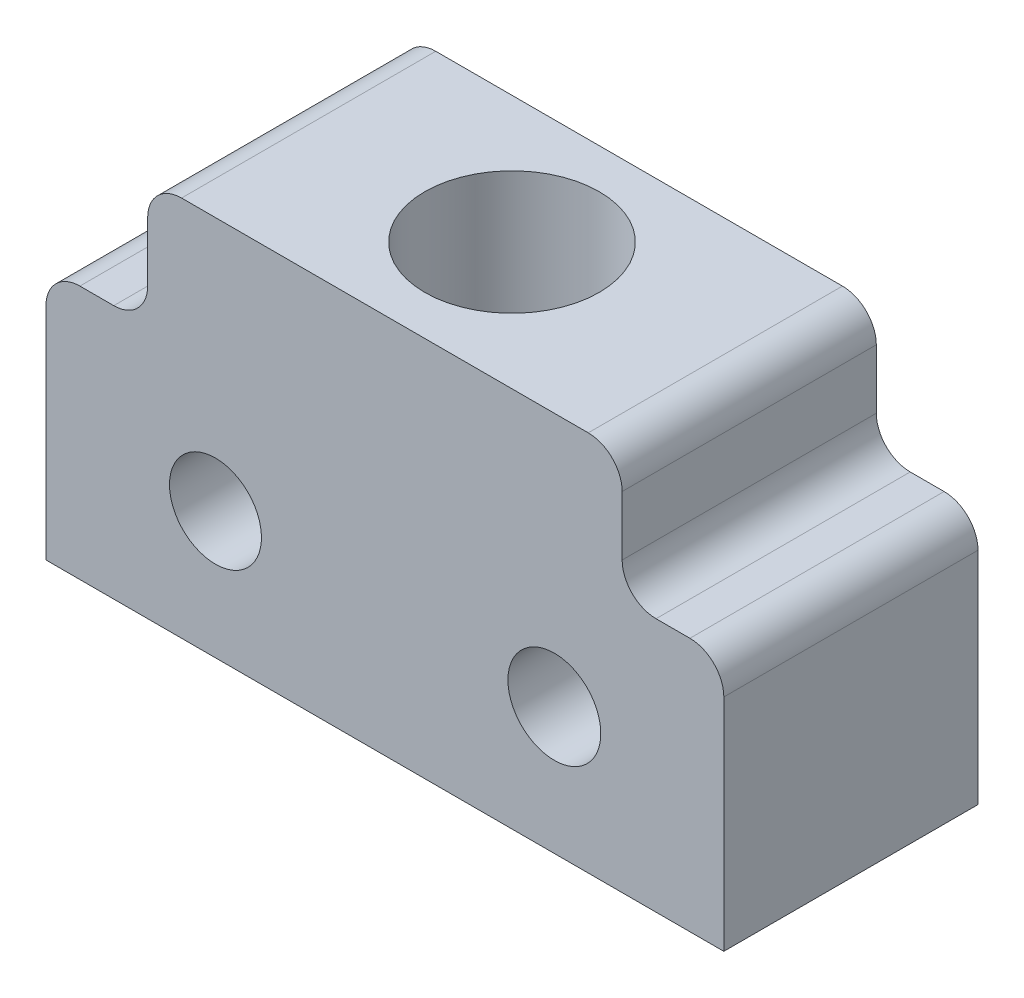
ISO-10303-21;
HEADER;
FILE_DESCRIPTION(('STEP AP214'),'2;1');
FILE_NAME('part.step','',(''),(''),'','','');
FILE_SCHEMA(('AUTOMOTIVE_DESIGN { 1 0 10303 214 1 1 1 1 }'));
ENDSEC;
DATA;
#1=APPLICATION_CONTEXT('core data for automotive mechanical design processes');
#2=APPLICATION_PROTOCOL_DEFINITION('international standard','automotive_design',2000,#1);
#3=PRODUCT_CONTEXT('',#1,'mechanical');
#4=PRODUCT('Part','Part','',(#3));
#5=PRODUCT_RELATED_PRODUCT_CATEGORY('part','',(#4));
#6=PRODUCT_DEFINITION_FORMATION('','',#4);
#7=PRODUCT_DEFINITION_CONTEXT('part definition',#1,'design');
#8=PRODUCT_DEFINITION('design','',#6,#7);
#9=PRODUCT_DEFINITION_SHAPE('','',#8);
#10=(LENGTH_UNIT() NAMED_UNIT(*) SI_UNIT(.MILLI.,.METRE.));
#11=(NAMED_UNIT(*) PLANE_ANGLE_UNIT() SI_UNIT($,.RADIAN.));
#12=(NAMED_UNIT(*) SI_UNIT($,.STERADIAN.) SOLID_ANGLE_UNIT());
#13=UNCERTAINTY_MEASURE_WITH_UNIT(LENGTH_MEASURE(1.E-05),#10,'distance_accuracy_value','');
#14=(GEOMETRIC_REPRESENTATION_CONTEXT(3) GLOBAL_UNCERTAINTY_ASSIGNED_CONTEXT((#13)) GLOBAL_UNIT_ASSIGNED_CONTEXT((#10,
#11,#12)) REPRESENTATION_CONTEXT('',''));
#15=CARTESIAN_POINT('',(0.,0.,0.));
#16=DIRECTION('',(0.,0.,1.));
#17=DIRECTION('',(1.,0.,0.));
#18=AXIS2_PLACEMENT_3D('',#15,#16,#17);
#19=CARTESIAN_POINT('',(0.,19.05,19.05));
#20=DIRECTION('',(0.,-1.,0.));
#21=DIRECTION('',(0.,0.,-1.));
#22=AXIS2_PLACEMENT_3D('',#19,#20,#21);
#23=PLANE('',#22);
#24=DIRECTION('',(-1.,0.,0.));
#25=VECTOR('',#24,1.);
#26=CARTESIAN_POINT('',(0.,19.05,0.));
#27=LINE('',#26,#25);
#28=CARTESIAN_POINT('',(5.08,19.05,0.));
#29=VERTEX_POINT('',#28);
#30=CARTESIAN_POINT('',(2.54,19.05,0.));
#31=VERTEX_POINT('',#30);
#32=EDGE_CURVE('E227',#29,#31,#27,.T.);
#33=ORIENTED_EDGE('',*,*,#32,.T.);
#34=DIRECTION('',(0.,0.,-1.));
#35=VECTOR('',#34,1.);
#36=CARTESIAN_POINT('',(2.54,19.05,19.05));
#37=LINE('',#36,#35);
#38=CARTESIAN_POINT('',(2.54,19.05,19.05));
#39=VERTEX_POINT('',#38);
#40=EDGE_CURVE('E186',#31,#39,#37,.F.);
#41=ORIENTED_EDGE('',*,*,#40,.T.);
#42=DIRECTION('',(-1.,0.,0.));
#43=VECTOR('',#42,1.);
#44=CARTESIAN_POINT('',(0.,19.05,19.05));
#45=LINE('',#44,#43);
#46=CARTESIAN_POINT('',(5.08,19.05,19.05));
#47=VERTEX_POINT('',#46);
#48=EDGE_CURVE('E241',#47,#39,#45,.T.);
#49=ORIENTED_EDGE('',*,*,#48,.F.);
#50=DIRECTION('',(0.,0.,1.));
#51=VECTOR('',#50,1.);
#52=CARTESIAN_POINT('',(5.08,19.05,0.));
#53=LINE('',#52,#51);
#54=EDGE_CURVE('E184',#47,#29,#53,.F.);
#55=ORIENTED_EDGE('',*,*,#54,.T.);
#56=EDGE_LOOP('',(#33,#41,#49,#55));
#57=FACE_BOUND('',#56,.T.);
#58=ADVANCED_FACE('F33',(#57),#23,.F.);
#59=CARTESIAN_POINT('',(48.26,19.05,19.05));
#60=VERTEX_POINT('',#59);
#61=CARTESIAN_POINT('',(45.72,19.05,19.05));
#62=VERTEX_POINT('',#61);
#63=EDGE_CURVE('E165',#60,#62,#45,.T.);
#64=ORIENTED_EDGE('',*,*,#63,.F.);
#65=DIRECTION('',(0.,0.,-1.));
#66=VECTOR('',#65,1.);
#67=CARTESIAN_POINT('',(48.26,19.05,19.05));
#68=LINE('',#67,#66);
#69=CARTESIAN_POINT('',(48.26,19.05,0.));
#70=VERTEX_POINT('',#69);
#71=EDGE_CURVE('E194',#60,#70,#68,.T.);
#72=ORIENTED_EDGE('',*,*,#71,.T.);
#73=CARTESIAN_POINT('',(45.72,19.05,0.));
#74=VERTEX_POINT('',#73);
#75=EDGE_CURVE('E146',#70,#74,#27,.T.);
#76=ORIENTED_EDGE('',*,*,#75,.T.);
#77=DIRECTION('',(0.,0.,-1.));
#78=VECTOR('',#77,1.);
#79=CARTESIAN_POINT('',(45.72,19.05,19.05));
#80=LINE('',#79,#78);
#81=EDGE_CURVE('E192',#74,#62,#80,.F.);
#82=ORIENTED_EDGE('',*,*,#81,.T.);
#83=EDGE_LOOP('',(#64,#72,#76,#82));
#84=FACE_BOUND('',#83,.T.);
#85=ADVANCED_FACE('F225',(#84),#23,.F.);
#86=CARTESIAN_POINT('',(0.,0.,19.05));
#87=DIRECTION('',(1.,0.,0.));
#88=DIRECTION('',(0.,0.,-1.));
#89=AXIS2_PLACEMENT_3D('',#86,#87,#88);
#90=PLANE('',#89);
#91=DIRECTION('',(0.,-1.,0.));
#92=VECTOR('',#91,1.);
#93=CARTESIAN_POINT('',(0.,0.,19.05));
#94=LINE('',#93,#92);
#95=CARTESIAN_POINT('',(0.,16.51,19.05));
#96=VERTEX_POINT('',#95);
#97=CARTESIAN_POINT('',(0.,0.,19.05));
#98=VERTEX_POINT('',#97);
#99=EDGE_CURVE('E133',#96,#98,#94,.T.);
#100=ORIENTED_EDGE('',*,*,#99,.F.);
#101=DIRECTION('',(0.,0.,-1.));
#102=VECTOR('',#101,1.);
#103=CARTESIAN_POINT('',(0.,16.51,19.05));
#104=LINE('',#103,#102);
#105=CARTESIAN_POINT('',(0.,16.51,0.));
#106=VERTEX_POINT('',#105);
#107=EDGE_CURVE('E182',#96,#106,#104,.T.);
#108=ORIENTED_EDGE('',*,*,#107,.T.);
#109=DIRECTION('',(0.,-1.,0.));
#110=VECTOR('',#109,1.);
#111=CARTESIAN_POINT('',(0.,0.,0.));
#112=LINE('',#111,#110);
#113=CARTESIAN_POINT('',(0.,0.,0.));
#114=VERTEX_POINT('',#113);
#115=EDGE_CURVE('E159',#106,#114,#112,.T.);
#116=ORIENTED_EDGE('',*,*,#115,.T.);
#117=DIRECTION('',(0.,0.,-1.));
#118=VECTOR('',#117,1.);
#119=CARTESIAN_POINT('',(0.,0.,19.05));
#120=LINE('',#119,#118);
#121=EDGE_CURVE('E151',#98,#114,#120,.T.);
#122=ORIENTED_EDGE('',*,*,#121,.F.);
#123=EDGE_LOOP('',(#100,#108,#116,#122));
#124=FACE_BOUND('',#123,.T.);
#125=ADVANCED_FACE('F157',(#124),#90,.F.);
#126=CARTESIAN_POINT('',(0.,0.,19.05));
#127=DIRECTION('',(0.,1.,0.));
#128=DIRECTION('',(0.,0.,1.));
#129=AXIS2_PLACEMENT_3D('',#126,#127,#128);
#130=PLANE('',#129);
#131=DIRECTION('',(1.,0.,0.));
#132=VECTOR('',#131,1.);
#133=CARTESIAN_POINT('',(0.,0.,0.));
#134=LINE('',#133,#132);
#135=CARTESIAN_POINT('',(50.8,0.,0.));
#136=VERTEX_POINT('',#135);
#137=EDGE_CURVE('E244',#114,#136,#134,.T.);
#138=ORIENTED_EDGE('',*,*,#137,.T.);
#139=DIRECTION('',(0.,0.,-1.));
#140=VECTOR('',#139,1.);
#141=CARTESIAN_POINT('',(50.8,0.,19.05));
#142=LINE('',#141,#140);
#143=CARTESIAN_POINT('',(50.8,0.,19.05));
#144=VERTEX_POINT('',#143);
#145=EDGE_CURVE('E153',#144,#136,#142,.T.);
#146=ORIENTED_EDGE('',*,*,#145,.F.);
#147=DIRECTION('',(1.,0.,0.));
#148=VECTOR('',#147,1.);
#149=CARTESIAN_POINT('',(0.,0.,19.05));
#150=LINE('',#149,#148);
#151=EDGE_CURVE('E137',#98,#144,#150,.T.);
#152=ORIENTED_EDGE('',*,*,#151,.F.);
#153=ORIENTED_EDGE('',*,*,#121,.T.);
#154=EDGE_LOOP('',(#138,#146,#152,#153));
#155=FACE_BOUND('',#154,.T.);
#156=ADVANCED_FACE('F150',(#155),#130,.F.);
#157=CARTESIAN_POINT('',(50.8,0.,19.05));
#158=DIRECTION('',(-1.,0.,0.));
#159=DIRECTION('',(0.,0.,1.));
#160=AXIS2_PLACEMENT_3D('',#157,#158,#159);
#161=PLANE('',#160);
#162=DIRECTION('',(0.,1.,0.));
#163=VECTOR('',#162,1.);
#164=CARTESIAN_POINT('',(50.8,0.,0.));
#165=LINE('',#164,#163);
#166=CARTESIAN_POINT('',(50.8,16.51,0.));
#167=VERTEX_POINT('',#166);
#168=EDGE_CURVE('E246',#136,#167,#165,.T.);
#169=ORIENTED_EDGE('',*,*,#168,.T.);
#170=DIRECTION('',(0.,0.,-1.));
#171=VECTOR('',#170,1.);
#172=CARTESIAN_POINT('',(50.8,16.51,19.05));
#173=LINE('',#172,#171);
#174=CARTESIAN_POINT('',(50.8,16.51,19.05));
#175=VERTEX_POINT('',#174);
#176=EDGE_CURVE('E201',#167,#175,#173,.F.);
#177=ORIENTED_EDGE('',*,*,#176,.T.);
#178=DIRECTION('',(0.,1.,0.));
#179=VECTOR('',#178,1.);
#180=CARTESIAN_POINT('',(50.8,0.,19.05));
#181=LINE('',#180,#179);
#182=EDGE_CURVE('E155',#144,#175,#181,.T.);
#183=ORIENTED_EDGE('',*,*,#182,.F.);
#184=ORIENTED_EDGE('',*,*,#145,.T.);
#185=EDGE_LOOP('',(#169,#177,#183,#184));
#186=FACE_BOUND('',#185,.T.);
#187=ADVANCED_FACE('F260',(#186),#161,.F.);
#188=CARTESIAN_POINT('',(0.,0.,19.05));
#189=DIRECTION('',(0.,0.,-1.));
#190=DIRECTION('',(-1.,0.,0.));
#191=AXIS2_PLACEMENT_3D('',#188,#189,#190);
#192=PLANE('',#191);
#193=CARTESIAN_POINT('',(12.7,9.525,19.05));
#194=DIRECTION('',(0.,0.,-1.));
#195=DIRECTION('',(-1.,0.,0.));
#196=AXIS2_PLACEMENT_3D('',#193,#194,#195);
#197=CIRCLE('',#196,3.44666093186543);
#198=CARTESIAN_POINT('',(9.25333906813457,9.525,19.05));
#199=VERTEX_POINT('',#198);
#200=EDGE_CURVE('E432',#199,#199,#197,.T.);
#201=ORIENTED_EDGE('',*,*,#200,.T.);
#202=EDGE_LOOP('',(#201));
#203=FACE_BOUND('',#202,.T.);
#204=CARTESIAN_POINT('',(38.1,9.525,19.05));
#205=DIRECTION('',(0.,0.,-1.));
#206=DIRECTION('',(-1.,0.,0.));
#207=AXIS2_PLACEMENT_3D('',#204,#205,#206);
#208=CIRCLE('',#207,3.48009670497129);
#209=CARTESIAN_POINT('',(34.6199032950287,9.525,19.05));
#210=VERTEX_POINT('',#209);
#211=EDGE_CURVE('E428',#210,#210,#208,.T.);
#212=ORIENTED_EDGE('',*,*,#211,.T.);
#213=EDGE_LOOP('',(#212));
#214=FACE_BOUND('',#213,.T.);
#215=ORIENTED_EDGE('',*,*,#182,.T.);
#216=CARTESIAN_POINT('',(48.26,16.51,19.05));
#217=DIRECTION('',(0.,0.,-1.));
#218=DIRECTION('',(-1.,0.,0.));
#219=AXIS2_PLACEMENT_3D('',#216,#217,#218);
#220=CIRCLE('',#219,2.54);
#221=EDGE_CURVE('E205',#175,#60,#220,.F.);
#222=ORIENTED_EDGE('',*,*,#221,.T.);
#223=ORIENTED_EDGE('',*,*,#63,.T.);
#224=CARTESIAN_POINT('',(45.72,21.59,19.05));
#225=DIRECTION('',(0.,0.,-1.));
#226=DIRECTION('',(-1.,0.,0.));
#227=AXIS2_PLACEMENT_3D('',#224,#225,#226);
#228=CIRCLE('',#227,2.54);
#229=CARTESIAN_POINT('',(43.18,21.59,19.05));
#230=VERTEX_POINT('',#229);
#231=EDGE_CURVE('E11',#62,#230,#228,.T.);
#232=ORIENTED_EDGE('',*,*,#231,.T.);
#233=DIRECTION('',(0.,-1.,0.));
#234=VECTOR('',#233,1.);
#235=CARTESIAN_POINT('',(43.18,28.575,19.05));
#236=LINE('',#235,#234);
#237=CARTESIAN_POINT('',(43.18,26.035,19.05));
#238=VERTEX_POINT('',#237);
#239=EDGE_CURVE('E230',#238,#230,#236,.T.);
#240=ORIENTED_EDGE('',*,*,#239,.F.);
#241=CARTESIAN_POINT('',(40.64,26.035,19.05));
#242=DIRECTION('',(0.,0.,-1.));
#243=DIRECTION('',(-1.,0.,0.));
#244=AXIS2_PLACEMENT_3D('',#241,#242,#243);
#245=CIRCLE('',#244,2.54);
#246=CARTESIAN_POINT('',(40.64,28.575,19.05));
#247=VERTEX_POINT('',#246);
#248=EDGE_CURVE('E203',#238,#247,#245,.F.);
#249=ORIENTED_EDGE('',*,*,#248,.T.);
#250=DIRECTION('',(1.,0.,0.));
#251=VECTOR('',#250,1.);
#252=CARTESIAN_POINT('',(7.62,28.575,19.05));
#253=LINE('',#252,#251);
#254=CARTESIAN_POINT('',(10.16,28.575,19.05));
#255=VERTEX_POINT('',#254);
#256=EDGE_CURVE('E423',#255,#247,#253,.T.);
#257=ORIENTED_EDGE('',*,*,#256,.F.);
#258=CARTESIAN_POINT('',(10.16,26.035,19.05));
#259=DIRECTION('',(0.,0.,-1.));
#260=DIRECTION('',(-1.,0.,0.));
#261=AXIS2_PLACEMENT_3D('',#258,#259,#260);
#262=CIRCLE('',#261,2.54);
#263=CARTESIAN_POINT('',(7.62,26.035,19.05));
#264=VERTEX_POINT('',#263);
#265=EDGE_CURVE('E170',#255,#264,#262,.F.);
#266=ORIENTED_EDGE('',*,*,#265,.T.);
#267=DIRECTION('',(0.,-1.,0.));
#268=VECTOR('',#267,1.);
#269=CARTESIAN_POINT('',(7.62,28.575,19.05));
#270=LINE('',#269,#268);
#271=CARTESIAN_POINT('',(7.62,21.59,19.05));
#272=VERTEX_POINT('',#271);
#273=EDGE_CURVE('E232',#264,#272,#270,.T.);
#274=ORIENTED_EDGE('',*,*,#273,.T.);
#275=CARTESIAN_POINT('',(5.08,21.59,19.05));
#276=DIRECTION('',(0.,0.,-1.));
#277=DIRECTION('',(-1.,0.,0.));
#278=AXIS2_PLACEMENT_3D('',#275,#276,#277);
#279=CIRCLE('',#278,2.54);
#280=EDGE_CURVE('E188',#272,#47,#279,.T.);
#281=ORIENTED_EDGE('',*,*,#280,.T.);
#282=ORIENTED_EDGE('',*,*,#48,.T.);
#283=CARTESIAN_POINT('',(2.54,16.51,19.05));
#284=DIRECTION('',(0.,0.,-1.));
#285=DIRECTION('',(-1.,0.,0.));
#286=AXIS2_PLACEMENT_3D('',#283,#284,#285);
#287=CIRCLE('',#286,2.54);
#288=EDGE_CURVE('E141',#39,#96,#287,.F.);
#289=ORIENTED_EDGE('',*,*,#288,.T.);
#290=ORIENTED_EDGE('',*,*,#99,.T.);
#291=ORIENTED_EDGE('',*,*,#151,.T.);
#292=EDGE_LOOP('',(#215,#222,#223,#232,#240,#249,#257,#266,#274,#281,#282,#289,#290,#291));
#293=FACE_BOUND('',#292,.T.);
#294=ADVANCED_FACE('F136',(#203,#214,#293),#192,.F.);
#295=CARTESIAN_POINT('',(0.,0.,0.));
#296=DIRECTION('',(0.,0.,-1.));
#297=DIRECTION('',(-1.,0.,0.));
#298=AXIS2_PLACEMENT_3D('',#295,#296,#297);
#299=PLANE('',#298);
#300=CARTESIAN_POINT('',(12.7,9.525,0.));
#301=DIRECTION('',(0.,0.,-1.));
#302=DIRECTION('',(-1.,0.,0.));
#303=AXIS2_PLACEMENT_3D('',#300,#301,#302);
#304=CIRCLE('',#303,3.44666093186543);
#305=CARTESIAN_POINT('',(9.25333906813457,9.525,0.));
#306=VERTEX_POINT('',#305);
#307=EDGE_CURVE('E435',#306,#306,#304,.T.);
#308=ORIENTED_EDGE('',*,*,#307,.F.);
#309=EDGE_LOOP('',(#308));
#310=FACE_BOUND('',#309,.T.);
#311=CARTESIAN_POINT('',(38.1,9.525,0.));
#312=DIRECTION('',(0.,0.,-1.));
#313=DIRECTION('',(-1.,0.,0.));
#314=AXIS2_PLACEMENT_3D('',#311,#312,#313);
#315=CIRCLE('',#314,3.48009670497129);
#316=CARTESIAN_POINT('',(34.6199032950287,9.525,0.));
#317=VERTEX_POINT('',#316);
#318=EDGE_CURVE('E429',#317,#317,#315,.T.);
#319=ORIENTED_EDGE('',*,*,#318,.F.);
#320=EDGE_LOOP('',(#319));
#321=FACE_BOUND('',#320,.T.);
#322=ORIENTED_EDGE('',*,*,#75,.F.);
#323=CARTESIAN_POINT('',(48.26,16.51,0.));
#324=DIRECTION('',(0.,0.,-1.));
#325=DIRECTION('',(-1.,0.,0.));
#326=AXIS2_PLACEMENT_3D('',#323,#324,#325);
#327=CIRCLE('',#326,2.54);
#328=EDGE_CURVE('E199',#70,#167,#327,.T.);
#329=ORIENTED_EDGE('',*,*,#328,.T.);
#330=ORIENTED_EDGE('',*,*,#168,.F.);
#331=ORIENTED_EDGE('',*,*,#137,.F.);
#332=ORIENTED_EDGE('',*,*,#115,.F.);
#333=CARTESIAN_POINT('',(2.54,16.51,0.));
#334=DIRECTION('',(0.,0.,-1.));
#335=DIRECTION('',(-1.,0.,0.));
#336=AXIS2_PLACEMENT_3D('',#333,#334,#335);
#337=CIRCLE('',#336,2.54);
#338=EDGE_CURVE('E177',#106,#31,#337,.T.);
#339=ORIENTED_EDGE('',*,*,#338,.T.);
#340=ORIENTED_EDGE('',*,*,#32,.F.);
#341=CARTESIAN_POINT('',(5.08,21.59,0.));
#342=DIRECTION('',(0.,0.,-1.));
#343=DIRECTION('',(-1.,0.,0.));
#344=AXIS2_PLACEMENT_3D('',#341,#342,#343);
#345=CIRCLE('',#344,2.54);
#346=CARTESIAN_POINT('',(7.62,21.59,0.));
#347=VERTEX_POINT('',#346);
#348=EDGE_CURVE('E190',#29,#347,#345,.F.);
#349=ORIENTED_EDGE('',*,*,#348,.T.);
#350=DIRECTION('',(0.,-1.,0.));
#351=VECTOR('',#350,1.);
#352=CARTESIAN_POINT('',(7.62,28.575,0.));
#353=LINE('',#352,#351);
#354=CARTESIAN_POINT('',(7.62,26.035,0.));
#355=VERTEX_POINT('',#354);
#356=EDGE_CURVE('E236',#355,#347,#353,.T.);
#357=ORIENTED_EDGE('',*,*,#356,.F.);
#358=CARTESIAN_POINT('',(10.16,26.035,0.));
#359=DIRECTION('',(0.,0.,-1.));
#360=DIRECTION('',(-1.,0.,0.));
#361=AXIS2_PLACEMENT_3D('',#358,#359,#360);
#362=CIRCLE('',#361,2.54);
#363=CARTESIAN_POINT('',(10.16,28.575,0.));
#364=VERTEX_POINT('',#363);
#365=EDGE_CURVE('E179',#355,#364,#362,.T.);
#366=ORIENTED_EDGE('',*,*,#365,.T.);
#367=DIRECTION('',(-1.,0.,0.));
#368=VECTOR('',#367,1.);
#369=CARTESIAN_POINT('',(7.62,28.575,0.));
#370=LINE('',#369,#368);
#371=CARTESIAN_POINT('',(40.64,28.575,0.));
#372=VERTEX_POINT('',#371);
#373=EDGE_CURVE('E422',#372,#364,#370,.T.);
#374=ORIENTED_EDGE('',*,*,#373,.F.);
#375=CARTESIAN_POINT('',(40.64,26.035,0.));
#376=DIRECTION('',(0.,0.,-1.));
#377=DIRECTION('',(-1.,0.,0.));
#378=AXIS2_PLACEMENT_3D('',#375,#376,#377);
#379=CIRCLE('',#378,2.54);
#380=CARTESIAN_POINT('',(43.18,26.035,0.));
#381=VERTEX_POINT('',#380);
#382=EDGE_CURVE('E197',#372,#381,#379,.T.);
#383=ORIENTED_EDGE('',*,*,#382,.T.);
#384=DIRECTION('',(0.,-1.,0.));
#385=VECTOR('',#384,1.);
#386=CARTESIAN_POINT('',(43.18,28.575,0.));
#387=LINE('',#386,#385);
#388=CARTESIAN_POINT('',(43.18,21.59,0.));
#389=VERTEX_POINT('',#388);
#390=EDGE_CURVE('E219',#381,#389,#387,.T.);
#391=ORIENTED_EDGE('',*,*,#390,.T.);
#392=CARTESIAN_POINT('',(45.72,21.59,0.));
#393=DIRECTION('',(0.,0.,-1.));
#394=DIRECTION('',(-1.,0.,0.));
#395=AXIS2_PLACEMENT_3D('',#392,#393,#394);
#396=CIRCLE('',#395,2.54);
#397=EDGE_CURVE('E42',#389,#74,#396,.F.);
#398=ORIENTED_EDGE('',*,*,#397,.T.);
#399=EDGE_LOOP('',(#322,#329,#330,#331,#332,#339,#340,#349,#357,#366,#374,#383,#391,#398));
#400=FACE_BOUND('',#399,.T.);
#401=ADVANCED_FACE('F218',(#310,#321,#400),#299,.T.);
#402=CARTESIAN_POINT('',(7.62,28.575,0.));
#403=DIRECTION('',(1.,0.,0.));
#404=DIRECTION('',(0.,0.,-1.));
#405=AXIS2_PLACEMENT_3D('',#402,#403,#404);
#406=PLANE('',#405);
#407=ORIENTED_EDGE('',*,*,#273,.F.);
#408=DIRECTION('',(0.,0.,1.));
#409=VECTOR('',#408,1.);
#410=CARTESIAN_POINT('',(7.62,26.035,0.));
#411=LINE('',#410,#409);
#412=EDGE_CURVE('E175',#264,#355,#411,.F.);
#413=ORIENTED_EDGE('',*,*,#412,.T.);
#414=ORIENTED_EDGE('',*,*,#356,.T.);
#415=DIRECTION('',(0.,0.,1.));
#416=VECTOR('',#415,1.);
#417=CARTESIAN_POINT('',(7.62,21.59,19.05));
#418=LINE('',#417,#416);
#419=EDGE_CURVE('E172',#347,#272,#418,.T.);
#420=ORIENTED_EDGE('',*,*,#419,.T.);
#421=EDGE_LOOP('',(#407,#413,#414,#420));
#422=FACE_BOUND('',#421,.T.);
#423=ADVANCED_FACE('F327',(#422),#406,.F.);
#424=CARTESIAN_POINT('',(43.18,28.575,0.));
#425=DIRECTION('',(-1.,0.,0.));
#426=DIRECTION('',(0.,0.,1.));
#427=AXIS2_PLACEMENT_3D('',#424,#425,#426);
#428=PLANE('',#427);
#429=ORIENTED_EDGE('',*,*,#239,.T.);
#430=DIRECTION('',(0.,0.,-1.));
#431=VECTOR('',#430,1.);
#432=CARTESIAN_POINT('',(43.18,21.59,0.));
#433=LINE('',#432,#431);
#434=EDGE_CURVE('E208',#230,#389,#433,.T.);
#435=ORIENTED_EDGE('',*,*,#434,.T.);
#436=ORIENTED_EDGE('',*,*,#390,.F.);
#437=DIRECTION('',(0.,0.,-1.));
#438=VECTOR('',#437,1.);
#439=CARTESIAN_POINT('',(43.18,26.035,19.05));
#440=LINE('',#439,#438);
#441=EDGE_CURVE('E54',#381,#238,#440,.F.);
#442=ORIENTED_EDGE('',*,*,#441,.T.);
#443=EDGE_LOOP('',(#429,#435,#436,#442));
#444=FACE_BOUND('',#443,.T.);
#445=ADVANCED_FACE('F229',(#444),#428,.F.);
#446=CARTESIAN_POINT('',(0.,28.575,0.));
#447=DIRECTION('',(0.,1.,0.));
#448=DIRECTION('',(0.,0.,1.));
#449=AXIS2_PLACEMENT_3D('',#446,#447,#448);
#450=PLANE('',#449);
#451=CARTESIAN_POINT('',(25.4,28.575,9.525));
#452=DIRECTION('',(0.,1.,0.));
#453=DIRECTION('',(0.,0.,1.));
#454=AXIS2_PLACEMENT_3D('',#451,#452,#453);
#455=CIRCLE('',#454,6.5405);
#456=CARTESIAN_POINT('',(25.4,28.575,16.0655));
#457=VERTEX_POINT('',#456);
#458=EDGE_CURVE('E443',#457,#457,#455,.T.);
#459=ORIENTED_EDGE('',*,*,#458,.F.);
#460=EDGE_LOOP('',(#459));
#461=FACE_BOUND('',#460,.T.);
#462=ORIENTED_EDGE('',*,*,#256,.T.);
#463=DIRECTION('',(0.,0.,-1.));
#464=VECTOR('',#463,1.);
#465=CARTESIAN_POINT('',(40.64,28.575,0.));
#466=LINE('',#465,#464);
#467=EDGE_CURVE('E211',#247,#372,#466,.T.);
#468=ORIENTED_EDGE('',*,*,#467,.T.);
#469=ORIENTED_EDGE('',*,*,#373,.T.);
#470=DIRECTION('',(0.,0.,1.));
#471=VECTOR('',#470,1.);
#472=CARTESIAN_POINT('',(10.16,28.575,19.05));
#473=LINE('',#472,#471);
#474=EDGE_CURVE('E161',#364,#255,#473,.T.);
#475=ORIENTED_EDGE('',*,*,#474,.T.);
#476=EDGE_LOOP('',(#462,#468,#469,#475));
#477=FACE_BOUND('',#476,.T.);
#478=ADVANCED_FACE('F334',(#461,#477),#450,.T.);
#479=CARTESIAN_POINT('',(38.1,9.525,19.05));
#480=DIRECTION('',(0.,0.,-1.));
#481=DIRECTION('',(-1.,0.,0.));
#482=AXIS2_PLACEMENT_3D('',#479,#480,#481);
#483=CYLINDRICAL_SURFACE('',#482,3.48009670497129);
#484=CARTESIAN_POINT('',(34.6199032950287,9.525,19.05));
#485=CARTESIAN_POINT('',(34.6199032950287,9.525,18.8515625));
#486=CARTESIAN_POINT('',(34.6199032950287,9.525,18.653125));
#487=CARTESIAN_POINT('',(34.6199032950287,9.525,18.25625));
#488=CARTESIAN_POINT('',(34.6199032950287,9.525,18.0578125));
#489=CARTESIAN_POINT('',(34.6199032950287,9.525,17.6609375));
#490=CARTESIAN_POINT('',(34.6199032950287,9.525,17.4625));
#491=CARTESIAN_POINT('',(34.6199032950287,9.525,17.065625));
#492=CARTESIAN_POINT('',(34.6199032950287,9.525,16.8671875));
#493=CARTESIAN_POINT('',(34.6199032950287,9.525,16.4703125));
#494=CARTESIAN_POINT('',(34.6199032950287,9.525,16.271875));
#495=CARTESIAN_POINT('',(34.6199032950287,9.525,15.875));
#496=CARTESIAN_POINT('',(34.6199032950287,9.525,15.6765625));
#497=CARTESIAN_POINT('',(34.6199032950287,9.525,15.2796875));
#498=CARTESIAN_POINT('',(34.6199032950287,9.525,15.08125));
#499=CARTESIAN_POINT('',(34.6199032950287,9.525,14.684375));
#500=CARTESIAN_POINT('',(34.6199032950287,9.525,14.4859375));
#501=CARTESIAN_POINT('',(34.6199032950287,9.525,14.0890625));
#502=CARTESIAN_POINT('',(34.6199032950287,9.525,13.890625));
#503=CARTESIAN_POINT('',(34.6199032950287,9.525,13.49375));
#504=CARTESIAN_POINT('',(34.6199032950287,9.525,13.2953125));
#505=CARTESIAN_POINT('',(34.6199032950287,9.525,12.8984375));
#506=CARTESIAN_POINT('',(34.6199032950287,9.525,12.7));
#507=CARTESIAN_POINT('',(34.6199032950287,9.525,12.303125));
#508=CARTESIAN_POINT('',(34.6199032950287,9.525,12.1046875));
#509=CARTESIAN_POINT('',(34.6199032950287,9.525,11.7078125));
#510=CARTESIAN_POINT('',(34.6199032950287,9.525,11.509375));
#511=CARTESIAN_POINT('',(34.6199032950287,9.525,11.1125));
#512=CARTESIAN_POINT('',(34.6199032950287,9.525,10.9140625));
#513=CARTESIAN_POINT('',(34.6199032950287,9.525,10.5171875));
#514=CARTESIAN_POINT('',(34.6199032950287,9.525,10.31875));
#515=CARTESIAN_POINT('',(34.6199032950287,9.525,9.921875));
#516=CARTESIAN_POINT('',(34.6199032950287,9.525,9.7234375));
#517=CARTESIAN_POINT('',(34.6199032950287,9.525,9.3265625));
#518=CARTESIAN_POINT('',(34.6199032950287,9.525,9.128125));
#519=CARTESIAN_POINT('',(34.6199032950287,9.525,8.73125));
#520=CARTESIAN_POINT('',(34.6199032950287,9.525,8.5328125));
#521=CARTESIAN_POINT('',(34.6199032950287,9.525,8.1359375));
#522=CARTESIAN_POINT('',(34.6199032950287,9.525,7.9375));
#523=CARTESIAN_POINT('',(34.6199032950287,9.525,7.540625));
#524=CARTESIAN_POINT('',(34.6199032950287,9.525,7.3421875));
#525=CARTESIAN_POINT('',(34.6199032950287,9.525,6.9453125));
#526=CARTESIAN_POINT('',(34.6199032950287,9.525,6.746875));
#527=CARTESIAN_POINT('',(34.6199032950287,9.525,6.35));
#528=CARTESIAN_POINT('',(34.6199032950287,9.525,6.1515625));
#529=CARTESIAN_POINT('',(34.6199032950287,9.525,5.7546875));
#530=CARTESIAN_POINT('',(34.6199032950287,9.525,5.55625));
#531=CARTESIAN_POINT('',(34.6199032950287,9.525,5.159375));
#532=CARTESIAN_POINT('',(34.6199032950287,9.525,4.9609375));
#533=CARTESIAN_POINT('',(34.6199032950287,9.525,4.5640625));
#534=CARTESIAN_POINT('',(34.6199032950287,9.525,4.365625));
#535=CARTESIAN_POINT('',(34.6199032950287,9.525,3.96875));
#536=CARTESIAN_POINT('',(34.6199032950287,9.525,3.7703125));
#537=CARTESIAN_POINT('',(34.6199032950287,9.525,3.3734375));
#538=CARTESIAN_POINT('',(34.6199032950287,9.525,3.175));
#539=CARTESIAN_POINT('',(34.6199032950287,9.525,2.778125));
#540=CARTESIAN_POINT('',(34.6199032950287,9.525,2.5796875));
#541=CARTESIAN_POINT('',(34.6199032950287,9.525,2.1828125));
#542=CARTESIAN_POINT('',(34.6199032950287,9.525,1.984375));
#543=CARTESIAN_POINT('',(34.6199032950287,9.525,1.5875));
#544=CARTESIAN_POINT('',(34.6199032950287,9.525,1.3890625));
#545=CARTESIAN_POINT('',(34.6199032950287,9.525,0.992187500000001));
#546=CARTESIAN_POINT('',(34.6199032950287,9.525,0.793750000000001));
#547=CARTESIAN_POINT('',(34.6199032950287,9.525,0.396875));
#548=CARTESIAN_POINT('',(34.6199032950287,9.525,0.1984375));
#549=CARTESIAN_POINT('',(34.6199032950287,9.525,0.));
#550=B_SPLINE_CURVE_WITH_KNOTS('',3,(#484,#485,#486,#487,#488,#489,#490,#491,#492,#493,#494,
#495,#496,#497,#498,#499,#500,#501,#502,#503,#504,#505,#506,#507,#508,#509,#510,#511,#512,#513,
#514,#515,#516,#517,#518,#519,#520,#521,#522,#523,#524,#525,#526,#527,#528,#529,#530,#531,#532,
#533,#534,#535,#536,#537,#538,#539,#540,#541,#542,#543,#544,#545,#546,#547,#548,#549),
.UNSPECIFIED.,.F.,.F.,(4,2,2,2,2,2,2,2,2,2,2,2,2,2,2,2,2,2,2,2,2,2,2,2,2,2,2,2,2,2,2,2,4),(0.,
0.5953125,1.190625,1.7859375,2.38125,2.9765625,3.571875,4.1671875,4.7625,5.3578125,5.953125,
6.5484375,7.14375,7.7390625,8.334375,8.9296875,9.525,10.1203125,10.715625,11.3109375,11.90625,
12.5015625,13.096875,13.6921875,14.2875,14.8828125,15.478125,16.0734375,16.66875,17.2640625,
17.859375,18.4546875,19.05),.UNSPECIFIED.);
#551=EDGE_CURVE('BSEAM374',#210,#317,#550,.T.);
#552=ORIENTED_EDGE('',*,*,#211,.F.);
#553=ORIENTED_EDGE('',*,*,#318,.T.);
#554=ORIENTED_EDGE('',*,*,#551,.T.);
#555=ORIENTED_EDGE('',*,*,#551,.F.);
#556=EDGE_LOOP('',(#552,#554,#553,#555));
#557=FACE_BOUND('',#556,.T.);
#558=ADVANCED_FACE('F374',(#557),#483,.F.);
#559=CARTESIAN_POINT('',(12.7,9.525,19.05));
#560=DIRECTION('',(0.,0.,-1.));
#561=DIRECTION('',(-1.,0.,0.));
#562=AXIS2_PLACEMENT_3D('',#559,#560,#561);
#563=CYLINDRICAL_SURFACE('',#562,3.44666093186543);
#564=CARTESIAN_POINT('',(9.25333906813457,9.525,19.05));
#565=CARTESIAN_POINT('',(9.25333906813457,9.525,18.8515625));
#566=CARTESIAN_POINT('',(9.25333906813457,9.525,18.653125));
#567=CARTESIAN_POINT('',(9.25333906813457,9.525,18.25625));
#568=CARTESIAN_POINT('',(9.25333906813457,9.525,18.0578125));
#569=CARTESIAN_POINT('',(9.25333906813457,9.525,17.6609375));
#570=CARTESIAN_POINT('',(9.25333906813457,9.525,17.4625));
#571=CARTESIAN_POINT('',(9.25333906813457,9.525,17.065625));
#572=CARTESIAN_POINT('',(9.25333906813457,9.525,16.8671875));
#573=CARTESIAN_POINT('',(9.25333906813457,9.525,16.4703125));
#574=CARTESIAN_POINT('',(9.25333906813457,9.525,16.271875));
#575=CARTESIAN_POINT('',(9.25333906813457,9.525,15.875));
#576=CARTESIAN_POINT('',(9.25333906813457,9.525,15.6765625));
#577=CARTESIAN_POINT('',(9.25333906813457,9.525,15.2796875));
#578=CARTESIAN_POINT('',(9.25333906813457,9.525,15.08125));
#579=CARTESIAN_POINT('',(9.25333906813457,9.525,14.684375));
#580=CARTESIAN_POINT('',(9.25333906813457,9.525,14.4859375));
#581=CARTESIAN_POINT('',(9.25333906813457,9.525,14.0890625));
#582=CARTESIAN_POINT('',(9.25333906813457,9.525,13.890625));
#583=CARTESIAN_POINT('',(9.25333906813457,9.525,13.49375));
#584=CARTESIAN_POINT('',(9.25333906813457,9.525,13.2953125));
#585=CARTESIAN_POINT('',(9.25333906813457,9.525,12.8984375));
#586=CARTESIAN_POINT('',(9.25333906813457,9.525,12.7));
#587=CARTESIAN_POINT('',(9.25333906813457,9.525,12.303125));
#588=CARTESIAN_POINT('',(9.25333906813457,9.525,12.1046875));
#589=CARTESIAN_POINT('',(9.25333906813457,9.525,11.7078125));
#590=CARTESIAN_POINT('',(9.25333906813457,9.525,11.509375));
#591=CARTESIAN_POINT('',(9.25333906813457,9.525,11.1125));
#592=CARTESIAN_POINT('',(9.25333906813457,9.525,10.9140625));
#593=CARTESIAN_POINT('',(9.25333906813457,9.525,10.5171875));
#594=CARTESIAN_POINT('',(9.25333906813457,9.525,10.31875));
#595=CARTESIAN_POINT('',(9.25333906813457,9.525,9.921875));
#596=CARTESIAN_POINT('',(9.25333906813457,9.525,9.7234375));
#597=CARTESIAN_POINT('',(9.25333906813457,9.525,9.3265625));
#598=CARTESIAN_POINT('',(9.25333906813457,9.525,9.128125));
#599=CARTESIAN_POINT('',(9.25333906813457,9.525,8.73125));
#600=CARTESIAN_POINT('',(9.25333906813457,9.525,8.5328125));
#601=CARTESIAN_POINT('',(9.25333906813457,9.525,8.1359375));
#602=CARTESIAN_POINT('',(9.25333906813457,9.525,7.9375));
#603=CARTESIAN_POINT('',(9.25333906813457,9.525,7.540625));
#604=CARTESIAN_POINT('',(9.25333906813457,9.525,7.3421875));
#605=CARTESIAN_POINT('',(9.25333906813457,9.525,6.9453125));
#606=CARTESIAN_POINT('',(9.25333906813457,9.525,6.746875));
#607=CARTESIAN_POINT('',(9.25333906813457,9.525,6.35));
#608=CARTESIAN_POINT('',(9.25333906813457,9.525,6.1515625));
#609=CARTESIAN_POINT('',(9.25333906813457,9.525,5.7546875));
#610=CARTESIAN_POINT('',(9.25333906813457,9.525,5.55625));
#611=CARTESIAN_POINT('',(9.25333906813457,9.525,5.159375));
#612=CARTESIAN_POINT('',(9.25333906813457,9.525,4.9609375));
#613=CARTESIAN_POINT('',(9.25333906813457,9.525,4.5640625));
#614=CARTESIAN_POINT('',(9.25333906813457,9.525,4.365625));
#615=CARTESIAN_POINT('',(9.25333906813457,9.525,3.96875));
#616=CARTESIAN_POINT('',(9.25333906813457,9.525,3.7703125));
#617=CARTESIAN_POINT('',(9.25333906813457,9.525,3.3734375));
#618=CARTESIAN_POINT('',(9.25333906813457,9.525,3.175));
#619=CARTESIAN_POINT('',(9.25333906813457,9.525,2.778125));
#620=CARTESIAN_POINT('',(9.25333906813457,9.525,2.5796875));
#621=CARTESIAN_POINT('',(9.25333906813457,9.525,2.1828125));
#622=CARTESIAN_POINT('',(9.25333906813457,9.525,1.984375));
#623=CARTESIAN_POINT('',(9.25333906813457,9.525,1.5875));
#624=CARTESIAN_POINT('',(9.25333906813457,9.525,1.3890625));
#625=CARTESIAN_POINT('',(9.25333906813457,9.525,0.992187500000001));
#626=CARTESIAN_POINT('',(9.25333906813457,9.525,0.793750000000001));
#627=CARTESIAN_POINT('',(9.25333906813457,9.525,0.396875));
#628=CARTESIAN_POINT('',(9.25333906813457,9.525,0.1984375));
#629=CARTESIAN_POINT('',(9.25333906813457,9.525,0.));
#630=B_SPLINE_CURVE_WITH_KNOTS('',3,(#564,#565,#566,#567,#568,#569,#570,#571,#572,#573,#574,
#575,#576,#577,#578,#579,#580,#581,#582,#583,#584,#585,#586,#587,#588,#589,#590,#591,#592,#593,
#594,#595,#596,#597,#598,#599,#600,#601,#602,#603,#604,#605,#606,#607,#608,#609,#610,#611,#612,
#613,#614,#615,#616,#617,#618,#619,#620,#621,#622,#623,#624,#625,#626,#627,#628,#629),
.UNSPECIFIED.,.F.,.F.,(4,2,2,2,2,2,2,2,2,2,2,2,2,2,2,2,2,2,2,2,2,2,2,2,2,2,2,2,2,2,2,2,4),(0.,
0.5953125,1.190625,1.7859375,2.38125,2.9765625,3.571875,4.1671875,4.7625,5.3578125,5.953125,
6.5484375,7.14375,7.7390625,8.334375,8.9296875,9.525,10.1203125,10.715625,11.3109375,11.90625,
12.5015625,13.096875,13.6921875,14.2875,14.8828125,15.478125,16.0734375,16.66875,17.2640625,
17.859375,18.4546875,19.05),.UNSPECIFIED.);
#631=EDGE_CURVE('BSEAM291',#199,#306,#630,.T.);
#632=ORIENTED_EDGE('',*,*,#200,.F.);
#633=ORIENTED_EDGE('',*,*,#307,.T.);
#634=ORIENTED_EDGE('',*,*,#631,.T.);
#635=ORIENTED_EDGE('',*,*,#631,.F.);
#636=EDGE_LOOP('',(#632,#634,#633,#635));
#637=FACE_BOUND('',#636,.T.);
#638=ADVANCED_FACE('F291',(#637),#563,.F.);
#639=CARTESIAN_POINT('',(10.16,26.035,0.));
#640=DIRECTION('',(0.,0.,-1.));
#641=DIRECTION('',(-1.,0.,0.));
#642=AXIS2_PLACEMENT_3D('',#639,#640,#641);
#643=CYLINDRICAL_SURFACE('',#642,2.54);
#644=ORIENTED_EDGE('',*,*,#365,.F.);
#645=ORIENTED_EDGE('',*,*,#412,.F.);
#646=ORIENTED_EDGE('',*,*,#265,.F.);
#647=ORIENTED_EDGE('',*,*,#474,.F.);
#648=EDGE_LOOP('',(#644,#645,#646,#647));
#649=FACE_BOUND('',#648,.T.);
#650=ADVANCED_FACE('F288',(#649),#643,.T.);
#651=CARTESIAN_POINT('',(2.54,16.51,19.05));
#652=DIRECTION('',(0.,0.,-1.));
#653=DIRECTION('',(-1.,0.,0.));
#654=AXIS2_PLACEMENT_3D('',#651,#652,#653);
#655=CYLINDRICAL_SURFACE('',#654,2.54);
#656=ORIENTED_EDGE('',*,*,#288,.F.);
#657=ORIENTED_EDGE('',*,*,#40,.F.);
#658=ORIENTED_EDGE('',*,*,#338,.F.);
#659=ORIENTED_EDGE('',*,*,#107,.F.);
#660=EDGE_LOOP('',(#656,#657,#658,#659));
#661=FACE_BOUND('',#660,.T.);
#662=ADVANCED_FACE('F259',(#661),#655,.T.);
#663=CARTESIAN_POINT('',(5.08,21.59,0.));
#664=DIRECTION('',(0.,0.,-1.));
#665=DIRECTION('',(-1.,0.,0.));
#666=AXIS2_PLACEMENT_3D('',#663,#664,#665);
#667=CYLINDRICAL_SURFACE('',#666,2.54);
#668=ORIENTED_EDGE('',*,*,#348,.F.);
#669=ORIENTED_EDGE('',*,*,#54,.F.);
#670=ORIENTED_EDGE('',*,*,#280,.F.);
#671=ORIENTED_EDGE('',*,*,#419,.F.);
#672=EDGE_LOOP('',(#668,#669,#670,#671));
#673=FACE_BOUND('',#672,.T.);
#674=ADVANCED_FACE('F265',(#673),#667,.F.);
#675=CARTESIAN_POINT('',(48.26,16.51,19.05));
#676=DIRECTION('',(0.,0.,-1.));
#677=DIRECTION('',(-1.,0.,0.));
#678=AXIS2_PLACEMENT_3D('',#675,#676,#677);
#679=CYLINDRICAL_SURFACE('',#678,2.54);
#680=ORIENTED_EDGE('',*,*,#221,.F.);
#681=ORIENTED_EDGE('',*,*,#176,.F.);
#682=ORIENTED_EDGE('',*,*,#328,.F.);
#683=ORIENTED_EDGE('',*,*,#71,.F.);
#684=EDGE_LOOP('',(#680,#681,#682,#683));
#685=FACE_BOUND('',#684,.T.);
#686=ADVANCED_FACE('F263',(#685),#679,.T.);
#687=CARTESIAN_POINT('',(45.72,21.59,0.));
#688=DIRECTION('',(0.,0.,1.));
#689=DIRECTION('',(1.,0.,0.));
#690=AXIS2_PLACEMENT_3D('',#687,#688,#689);
#691=CYLINDRICAL_SURFACE('',#690,2.54);
#692=ORIENTED_EDGE('',*,*,#231,.F.);
#693=ORIENTED_EDGE('',*,*,#81,.F.);
#694=ORIENTED_EDGE('',*,*,#397,.F.);
#695=ORIENTED_EDGE('',*,*,#434,.F.);
#696=EDGE_LOOP('',(#692,#693,#694,#695));
#697=FACE_BOUND('',#696,.T.);
#698=ADVANCED_FACE('F228',(#697),#691,.F.);
#699=CARTESIAN_POINT('',(40.64,26.035,0.));
#700=DIRECTION('',(0.,0.,1.));
#701=DIRECTION('',(1.,0.,0.));
#702=AXIS2_PLACEMENT_3D('',#699,#700,#701);
#703=CYLINDRICAL_SURFACE('',#702,2.54);
#704=ORIENTED_EDGE('',*,*,#248,.F.);
#705=ORIENTED_EDGE('',*,*,#441,.F.);
#706=ORIENTED_EDGE('',*,*,#382,.F.);
#707=ORIENTED_EDGE('',*,*,#467,.F.);
#708=EDGE_LOOP('',(#704,#705,#706,#707));
#709=FACE_BOUND('',#708,.T.);
#710=ADVANCED_FACE('F35',(#709),#703,.T.);
#711=CARTESIAN_POINT('',(25.4,17.907,9.525));
#712=DIRECTION('',(0.,1.,0.));
#713=DIRECTION('',(0.,0.,1.));
#714=AXIS2_PLACEMENT_3D('',#711,#712,#713);
#715=PLANE('',#714);
#716=CARTESIAN_POINT('',(25.4,17.907,9.525));
#717=DIRECTION('',(0.,1.,0.));
#718=DIRECTION('',(0.,0.,1.));
#719=AXIS2_PLACEMENT_3D('',#716,#717,#718);
#720=CIRCLE('',#719,6.5405);
#721=CARTESIAN_POINT('',(25.4,17.907,16.0655));
#722=VERTEX_POINT('',#721);
#723=EDGE_CURVE('E446',#722,#722,#720,.T.);
#724=ORIENTED_EDGE('',*,*,#723,.T.);
#725=EDGE_LOOP('',(#724));
#726=FACE_BOUND('',#725,.T.);
#727=CARTESIAN_POINT('',(25.4,17.907,9.525));
#728=DIRECTION('',(0.,1.,0.));
#729=DIRECTION('',(0.,0.,1.));
#730=AXIS2_PLACEMENT_3D('',#727,#728,#729);
#731=CIRCLE('',#730,6.35);
#732=CARTESIAN_POINT('',(25.4,17.907,15.875));
#733=VERTEX_POINT('',#732);
#734=EDGE_CURVE('E37',#733,#733,#731,.F.);
#735=ORIENTED_EDGE('',*,*,#734,.T.);
#736=EDGE_LOOP('',(#735));
#737=FACE_BOUND('',#736,.T.);
#738=ADVANCED_FACE('F353',(#726,#737),#715,.T.);
#739=CARTESIAN_POINT('',(25.4,17.907,9.525));
#740=DIRECTION('',(0.,1.,0.));
#741=DIRECTION('',(0.,0.,1.));
#742=AXIS2_PLACEMENT_3D('',#739,#740,#741);
#743=CYLINDRICAL_SURFACE('',#742,6.5405);
#744=ORIENTED_EDGE('',*,*,#723,.F.);
#745=EDGE_LOOP('',(#744));
#746=FACE_BOUND('',#745,.T.);
#747=ORIENTED_EDGE('',*,*,#458,.T.);
#748=EDGE_LOOP('',(#747));
#749=FACE_BOUND('',#748,.T.);
#750=ADVANCED_FACE('F364',(#746,#749),#743,.F.);
#751=CARTESIAN_POINT('',(25.4,16.383,9.525));
#752=DIRECTION('',(0.,1.,0.));
#753=DIRECTION('',(0.,0.,1.));
#754=AXIS2_PLACEMENT_3D('',#751,#752,#753);
#755=PLANE('',#754);
#756=CARTESIAN_POINT('',(25.4,16.383,9.525));
#757=DIRECTION('',(0.,1.,0.));
#758=DIRECTION('',(0.,0.,1.));
#759=AXIS2_PLACEMENT_3D('',#756,#757,#758);
#760=CIRCLE('',#759,6.35);
#761=CARTESIAN_POINT('',(25.4,16.383,15.875));
#762=VERTEX_POINT('',#761);
#763=EDGE_CURVE('E438',#762,#762,#760,.T.);
#764=ORIENTED_EDGE('',*,*,#763,.T.);
#765=EDGE_LOOP('',(#764));
#766=FACE_BOUND('',#765,.T.);
#767=ADVANCED_FACE('F360',(#766),#755,.T.);
#768=CARTESIAN_POINT('',(25.4,16.383,9.525));
#769=DIRECTION('',(0.,1.,0.));
#770=DIRECTION('',(0.,0.,1.));
#771=AXIS2_PLACEMENT_3D('',#768,#769,#770);
#772=CYLINDRICAL_SURFACE('',#771,6.35);
#773=ORIENTED_EDGE('',*,*,#763,.F.);
#774=EDGE_LOOP('',(#773));
#775=FACE_BOUND('',#774,.T.);
#776=ORIENTED_EDGE('',*,*,#734,.F.);
#777=EDGE_LOOP('',(#776));
#778=FACE_BOUND('',#777,.T.);
#779=ADVANCED_FACE('F363',(#775,#778),#772,.F.);
#780=CLOSED_SHELL('',(#58,#85,#125,#156,#187,#294,#401,#423,#445,#478,#558,#638,#650,#662,#674,
#686,#698,#710,#738,#750,#767,#779));
#781=MANIFOLD_SOLID_BREP('B2',#780);
#782=ADVANCED_BREP_SHAPE_REPRESENTATION('',(#18,#781),#14);
#783=SHAPE_DEFINITION_REPRESENTATION(#9,#782);
ENDSEC;
END-ISO-10303-21;
